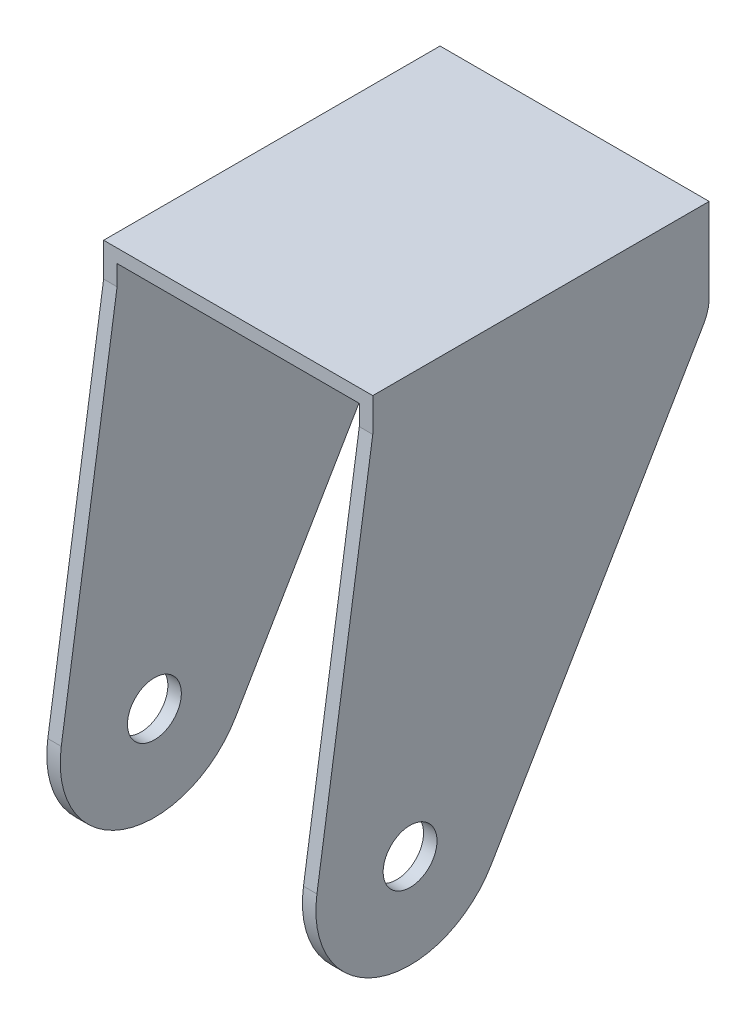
from build123d import *

# Parameters (mm, degrees)
BOSS_EXTRUDE1_DEPTH = 2
SKETCH2_W           = 40
SKETCH2_H           = 50
BOSS_EXTRUDE2_DEPTH = 2
BOSS_EXTRUDE3_DEPTH = 4
SKETCH5_R           = 4
CUT_EXTRUDE2_DEPTH  = 44


with BuildPart() as part:
    # Sketch1 → Boss-Extrude1 (new body)
    with BuildSketch(Plane(origin=(0, 0, 0), x_dir=(0, 0, -1), z_dir=(1, 0, 0))):
        with BuildLine():
            Line((-13.843343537, 2.088501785), (-5.545666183, 57.088501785))
            Line((-5.545666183, 57.088501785), (-5.545666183, 62.088501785))
            Line((-5.545666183, 62.088501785), (44.454333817, 62.088501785))
            Line((44.454333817, 62.088501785), (44.454333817, 49.719071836))
            ThreePointArc((44.454333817, 49.719071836), (44.244333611, 48.145571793), (43.629033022, 46.682216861))
            Line((43.629033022, 46.682216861), (12.074298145, -7.085994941))
            ThreePointArc((12.074298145, -7.085994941), (-4.671747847, -13.197529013), (-13.843343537, 2.088501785))
        make_face()
    extrude(amount=-BOSS_EXTRUDE1_DEPTH)


with BuildPart() as body_2:
    # Mirror1: mirrored copy
    add(part.part.mirror(Plane(origin=(-20, 0, 0), x_dir=(0, 0, 1), z_dir=(1, 0, 0))))


with BuildPart() as part_1:
    add(part.part)

    add(body_2.part)  # Boss-Extrude2 merges body 2
    # Sketch2 → Boss-Extrude2 (add)
    with BuildSketch(Plane(origin=(0, 62.088501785, 0), x_dir=(1, 0, 0), z_dir=(0, 1, 0))):
        with Locations((-20, 19.454333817)):
            Rectangle(SKETCH2_W, SKETCH2_H)
    extrude(amount=-BOSS_EXTRUDE2_DEPTH)

    # Sketch3 → Boss-Extrude3 (add)
    with BuildSketch(Plane(origin=(0, 62.088501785, 0), x_dir=(1, 0, 0), z_dir=(0, 1, 0))):
        with BuildLine():
            Line((-18, 13.59419702), (-9.643842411, 29.454333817))
            ThreePointArc((-9.643842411, 29.454333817), (-20, 11.392155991), (-30.356157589, 29.454333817))
            Line((-30.356157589, 29.454333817), (-22, 13.59419702))
            ThreePointArc((-22, 13.59419702), (-20, 13.392155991), (-18, 13.59419702))
        make_face()
    extrude(amount=-BOSS_EXTRUDE3_DEPTH)

    # Sketch5 → Cut-Extrude2 (cut)
    with BuildSketch(Plane(origin=(0, 0, 0), x_dir=(0, 0, -1), z_dir=(1, 0, 0))):
        with Locations(Location((0, 0, 0), (0, 0, 180))):
            Circle(SKETCH5_R)
    extrude(amount=-CUT_EXTRUDE2_DEPTH, mode=Mode.SUBTRACT)


solid = part_1.part
